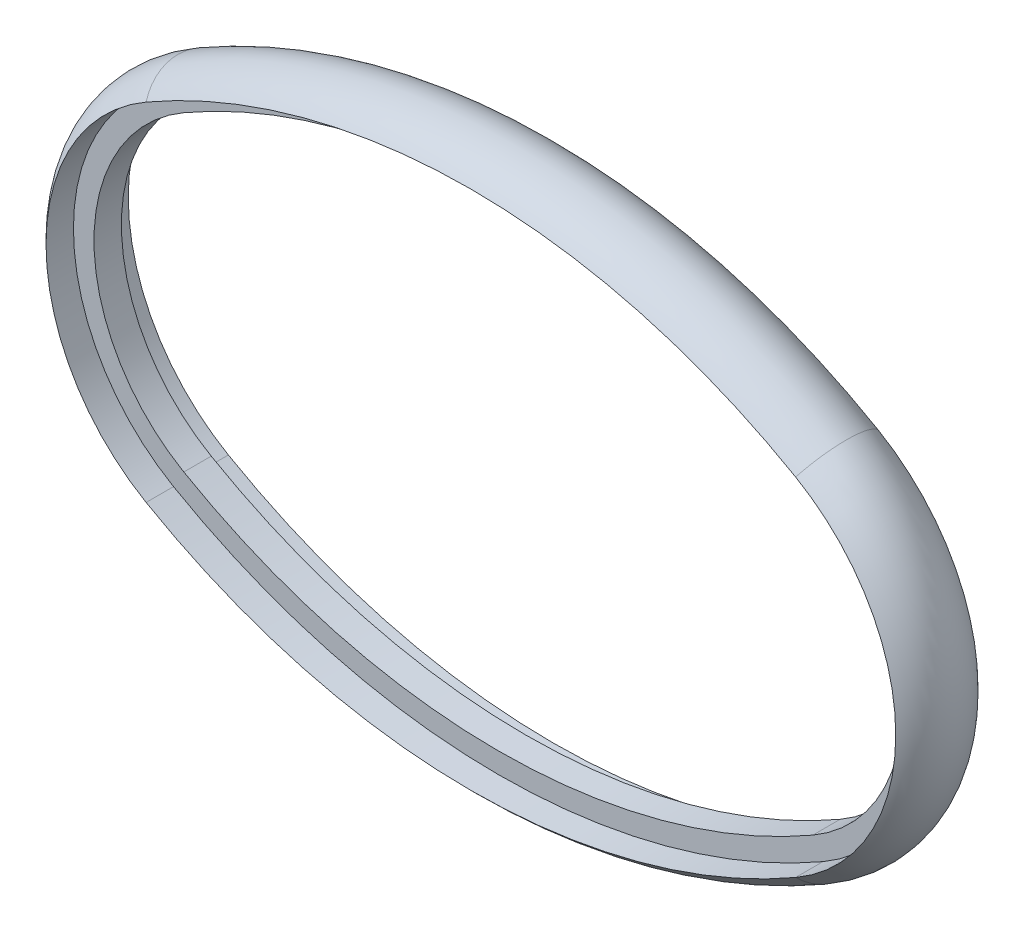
ISO-10303-21;
HEADER;
FILE_DESCRIPTION(('STEP AP214'),'2;1');
FILE_NAME('part.step','',(''),(''),'','','');
FILE_SCHEMA(('AUTOMOTIVE_DESIGN { 1 0 10303 214 1 1 1 1 }'));
ENDSEC;
DATA;
#1=APPLICATION_CONTEXT('core data for automotive mechanical design processes');
#2=APPLICATION_PROTOCOL_DEFINITION('international standard','automotive_design',2000,#1);
#3=PRODUCT_CONTEXT('',#1,'mechanical');
#4=PRODUCT('Part','Part','',(#3));
#5=PRODUCT_RELATED_PRODUCT_CATEGORY('part','',(#4));
#6=PRODUCT_DEFINITION_FORMATION('','',#4);
#7=PRODUCT_DEFINITION_CONTEXT('part definition',#1,'design');
#8=PRODUCT_DEFINITION('design','',#6,#7);
#9=PRODUCT_DEFINITION_SHAPE('','',#8);
#10=(LENGTH_UNIT() NAMED_UNIT(*) SI_UNIT(.MILLI.,.METRE.));
#11=(NAMED_UNIT(*) PLANE_ANGLE_UNIT() SI_UNIT($,.RADIAN.));
#12=(NAMED_UNIT(*) SI_UNIT($,.STERADIAN.) SOLID_ANGLE_UNIT());
#13=UNCERTAINTY_MEASURE_WITH_UNIT(LENGTH_MEASURE(1.E-05),#10,'distance_accuracy_value','');
#14=(GEOMETRIC_REPRESENTATION_CONTEXT(3) GLOBAL_UNCERTAINTY_ASSIGNED_CONTEXT((#13)) GLOBAL_UNIT_ASSIGNED_CONTEXT((#10,
#11,#12)) REPRESENTATION_CONTEXT('',''));
#15=CARTESIAN_POINT('',(0.,0.,0.));
#16=DIRECTION('',(0.,0.,1.));
#17=DIRECTION('',(1.,0.,0.));
#18=AXIS2_PLACEMENT_3D('',#15,#16,#17);
#19=CARTESIAN_POINT('',(16.3923048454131,-19.0000000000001,0.));
#20=DIRECTION('',(0.,0.,1.));
#21=DIRECTION('',(1.,0.,0.));
#22=AXIS2_PLACEMENT_3D('',#19,#20,#21);
#23=CYLINDRICAL_SURFACE('',#22,14.6076951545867);
#24=DIRECTION('',(0.,0.,-1.));
#25=VECTOR('',#24,1.);
#26=CARTESIAN_POINT('',(23.6961524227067,-31.6506350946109,-1.));
#27=LINE('',#26,#25);
#28=CARTESIAN_POINT('',(23.6961524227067,-31.6506350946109,-1.));
#29=VERTEX_POINT('',#28);
#30=CARTESIAN_POINT('',(23.6961524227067,-31.6506350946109,-3.));
#31=VERTEX_POINT('',#30);
#32=EDGE_CURVE('E223',#29,#31,#27,.T.);
#33=ORIENTED_EDGE('',*,*,#32,.F.);
#34=CARTESIAN_POINT('',(16.3923048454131,-19.0000000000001,-1.));
#35=DIRECTION('',(0.,0.,1.));
#36=DIRECTION('',(1.,0.,0.));
#37=AXIS2_PLACEMENT_3D('',#34,#35,#36);
#38=CIRCLE('',#37,14.6076951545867);
#39=CARTESIAN_POINT('',(23.6961524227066,-6.34936490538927,-1.));
#40=VERTEX_POINT('',#39);
#41=EDGE_CURVE('E53',#29,#40,#38,.T.);
#42=ORIENTED_EDGE('',*,*,#41,.T.);
#43=DIRECTION('',(0.,0.,-1.));
#44=VECTOR('',#43,1.);
#45=CARTESIAN_POINT('',(23.6961524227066,-6.34936490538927,-1.));
#46=LINE('',#45,#44);
#47=CARTESIAN_POINT('',(23.6961524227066,-6.34936490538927,-3.));
#48=VERTEX_POINT('',#47);
#49=EDGE_CURVE('E260',#40,#48,#46,.T.);
#50=ORIENTED_EDGE('',*,*,#49,.T.);
#51=CARTESIAN_POINT('',(16.3923048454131,-19.0000000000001,-3.));
#52=DIRECTION('',(0.,0.,1.));
#53=DIRECTION('',(1.,0.,0.));
#54=AXIS2_PLACEMENT_3D('',#51,#52,#53);
#55=CIRCLE('',#54,14.6076951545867);
#56=EDGE_CURVE('E11',#31,#48,#55,.T.);
#57=ORIENTED_EDGE('',*,*,#56,.F.);
#58=EDGE_LOOP('',(#33,#42,#50,#57));
#59=FACE_BOUND('',#58,.T.);
#60=ADVANCED_FACE('F44',(#59),#23,.F.);
#61=CARTESIAN_POINT('',(16.3923048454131,-19.0000000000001,0.));
#62=DIRECTION('',(0.,0.,1.));
#63=DIRECTION('',(1.,0.,0.));
#64=AXIS2_PLACEMENT_3D('',#61,#62,#63);
#65=CYLINDRICAL_SURFACE('',#64,13.1076951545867);
#66=DIRECTION('',(0.,0.,-1.));
#67=VECTOR('',#66,1.);
#68=CARTESIAN_POINT('',(22.9461524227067,-30.3515969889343,1.));
#69=LINE('',#68,#67);
#70=CARTESIAN_POINT('',(22.9461524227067,-30.3515969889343,1.));
#71=VERTEX_POINT('',#70);
#72=CARTESIAN_POINT('',(22.9461524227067,-30.3515969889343,-0.999999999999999));
#73=VERTEX_POINT('',#72);
#74=EDGE_CURVE('E219',#71,#73,#69,.T.);
#75=ORIENTED_EDGE('',*,*,#74,.F.);
#76=CARTESIAN_POINT('',(16.3923048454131,-19.0000000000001,1.));
#77=DIRECTION('',(0.,0.,1.));
#78=DIRECTION('',(1.,0.,0.));
#79=AXIS2_PLACEMENT_3D('',#76,#77,#78);
#80=CIRCLE('',#79,13.1076951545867);
#81=CARTESIAN_POINT('',(22.9461524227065,-7.64840301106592,1.));
#82=VERTEX_POINT('',#81);
#83=EDGE_CURVE('E272',#71,#82,#80,.T.);
#84=ORIENTED_EDGE('',*,*,#83,.T.);
#85=DIRECTION('',(0.,0.,-1.));
#86=VECTOR('',#85,1.);
#87=CARTESIAN_POINT('',(22.9461524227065,-7.64840301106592,1.));
#88=LINE('',#87,#86);
#89=CARTESIAN_POINT('',(22.9461524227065,-7.64840301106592,-0.999999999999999));
#90=VERTEX_POINT('',#89);
#91=EDGE_CURVE('E256',#82,#90,#88,.T.);
#92=ORIENTED_EDGE('',*,*,#91,.T.);
#93=CARTESIAN_POINT('',(16.3923048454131,-19.0000000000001,-0.999999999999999));
#94=DIRECTION('',(0.,0.,1.));
#95=DIRECTION('',(1.,0.,0.));
#96=AXIS2_PLACEMENT_3D('',#93,#94,#95);
#97=CIRCLE('',#96,13.1076951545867);
#98=EDGE_CURVE('E276',#73,#90,#97,.T.);
#99=ORIENTED_EDGE('',*,*,#98,.F.);
#100=EDGE_LOOP('',(#75,#84,#92,#99));
#101=FACE_BOUND('',#100,.T.);
#102=ADVANCED_FACE('F343',(#101),#65,.F.);
#103=CARTESIAN_POINT('',(16.3923048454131,-19.0000000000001,0.));
#104=DIRECTION('',(0.,0.,1.));
#105=DIRECTION('',(1.,0.,0.));
#106=AXIS2_PLACEMENT_3D('',#103,#104,#105);
#107=CYLINDRICAL_SURFACE('',#106,14.6076951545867);
#108=DIRECTION('',(0.,0.,-1.));
#109=VECTOR('',#108,1.);
#110=CARTESIAN_POINT('',(23.6961524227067,-31.6506350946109,3.));
#111=LINE('',#110,#109);
#112=CARTESIAN_POINT('',(23.6961524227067,-31.6506350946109,3.));
#113=VERTEX_POINT('',#112);
#114=CARTESIAN_POINT('',(23.6961524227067,-31.6506350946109,1.));
#115=VERTEX_POINT('',#114);
#116=EDGE_CURVE('E215',#113,#115,#111,.T.);
#117=ORIENTED_EDGE('',*,*,#116,.F.);
#118=CARTESIAN_POINT('',(16.3923048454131,-19.0000000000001,3.));
#119=DIRECTION('',(0.,0.,1.));
#120=DIRECTION('',(1.,0.,0.));
#121=AXIS2_PLACEMENT_3D('',#118,#119,#120);
#122=CIRCLE('',#121,14.6076951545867);
#123=CARTESIAN_POINT('',(23.6961524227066,-6.34936490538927,3.));
#124=VERTEX_POINT('',#123);
#125=EDGE_CURVE('E264',#113,#124,#122,.T.);
#126=ORIENTED_EDGE('',*,*,#125,.T.);
#127=DIRECTION('',(0.,0.,-1.));
#128=VECTOR('',#127,1.);
#129=CARTESIAN_POINT('',(23.6961524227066,-6.34936490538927,3.));
#130=LINE('',#129,#128);
#131=CARTESIAN_POINT('',(23.6961524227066,-6.34936490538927,1.));
#132=VERTEX_POINT('',#131);
#133=EDGE_CURVE('E165',#124,#132,#130,.T.);
#134=ORIENTED_EDGE('',*,*,#133,.T.);
#135=CARTESIAN_POINT('',(16.3923048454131,-19.0000000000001,1.));
#136=DIRECTION('',(0.,0.,1.));
#137=DIRECTION('',(1.,0.,0.));
#138=AXIS2_PLACEMENT_3D('',#135,#136,#137);
#139=CIRCLE('',#138,14.6076951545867);
#140=EDGE_CURVE('E268',#115,#132,#139,.T.);
#141=ORIENTED_EDGE('',*,*,#140,.F.);
#142=EDGE_LOOP('',(#117,#126,#134,#141));
#143=FACE_BOUND('',#142,.T.);
#144=ADVANCED_FACE('F307',(#143),#107,.F.);
#145=CARTESIAN_POINT('',(16.3923048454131,-19.0000000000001,0.));
#146=DIRECTION('',(0.,0.,1.));
#147=DIRECTION('',(1.,0.,0.));
#148=AXIS2_PLACEMENT_3D('',#145,#146,#147);
#149=TOROIDAL_SURFACE('',#148,11.9619438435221,4.);
#150=CARTESIAN_POINT('',(22.3732767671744,-29.359347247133,0.));
#151=DIRECTION('',(-0.866025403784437,-0.500000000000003,0.));
#152=DIRECTION('',(0.,0.,1.));
#153=AXIS2_PLACEMENT_3D('',#150,#151,#152);
#154=CIRCLE('',#153,4.);
#155=EDGE_CURVE('E211',#31,#113,#154,.T.);
#156=ORIENTED_EDGE('',*,*,#155,.F.);
#157=ORIENTED_EDGE('',*,*,#56,.T.);
#158=CARTESIAN_POINT('',(22.3732767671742,-8.64065275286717,0.));
#159=DIRECTION('',(0.866025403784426,-0.500000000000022,0.));
#160=DIRECTION('',(0.,0.,1.));
#161=AXIS2_PLACEMENT_3D('',#158,#159,#160);
#162=CIRCLE('',#161,4.);
#163=EDGE_CURVE('E251',#48,#124,#162,.T.);
#164=ORIENTED_EDGE('',*,*,#163,.T.);
#165=ORIENTED_EDGE('',*,*,#125,.F.);
#166=EDGE_LOOP('',(#156,#157,#164,#165));
#167=FACE_BOUND('',#166,.T.);
#168=ADVANCED_FACE('F316',(#167),#149,.T.);
#169=CARTESIAN_POINT('',(0.,9.39230484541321,0.));
#170=DIRECTION('',(0.,0.,1.));
#171=DIRECTION('',(1.,0.,0.));
#172=AXIS2_PLACEMENT_3D('',#169,#170,#171);
#173=CYLINDRICAL_SURFACE('',#172,47.3923048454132);
#174=DIRECTION('',(0.,0.,-1.));
#175=VECTOR('',#174,1.);
#176=CARTESIAN_POINT('',(-23.6961524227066,-31.650635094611,-1.));
#177=LINE('',#176,#175);
#178=CARTESIAN_POINT('',(-23.6961524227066,-31.650635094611,-1.));
#179=VERTEX_POINT('',#178);
#180=CARTESIAN_POINT('',(-23.6961524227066,-31.650635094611,-3.));
#181=VERTEX_POINT('',#180);
#182=EDGE_CURVE('E149',#179,#181,#177,.T.);
#183=ORIENTED_EDGE('',*,*,#182,.F.);
#184=CARTESIAN_POINT('',(0.,9.39230484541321,-1.));
#185=DIRECTION('',(0.,0.,1.));
#186=DIRECTION('',(1.,0.,0.));
#187=AXIS2_PLACEMENT_3D('',#184,#185,#186);
#188=CIRCLE('',#187,47.3923048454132);
#189=EDGE_CURVE('E243',#179,#29,#188,.T.);
#190=ORIENTED_EDGE('',*,*,#189,.T.);
#191=ORIENTED_EDGE('',*,*,#32,.T.);
#192=CARTESIAN_POINT('',(0.,9.39230484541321,-3.));
#193=DIRECTION('',(0.,0.,1.));
#194=DIRECTION('',(1.,0.,0.));
#195=AXIS2_PLACEMENT_3D('',#192,#193,#194);
#196=CIRCLE('',#195,47.3923048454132);
#197=EDGE_CURVE('E247',#181,#31,#196,.T.);
#198=ORIENTED_EDGE('',*,*,#197,.F.);
#199=EDGE_LOOP('',(#183,#190,#191,#198));
#200=FACE_BOUND('',#199,.T.);
#201=ADVANCED_FACE('F320',(#200),#173,.F.);
#202=CARTESIAN_POINT('',(0.,9.39230484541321,0.));
#203=DIRECTION('',(0.,0.,1.));
#204=DIRECTION('',(1.,0.,0.));
#205=AXIS2_PLACEMENT_3D('',#202,#203,#204);
#206=CYLINDRICAL_SURFACE('',#205,45.8923048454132);
#207=DIRECTION('',(0.,0.,-1.));
#208=VECTOR('',#207,1.);
#209=CARTESIAN_POINT('',(-22.9461524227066,-30.3515969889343,1.));
#210=LINE('',#209,#208);
#211=CARTESIAN_POINT('',(-22.9461524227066,-30.3515969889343,1.));
#212=VERTEX_POINT('',#211);
#213=CARTESIAN_POINT('',(-22.9461524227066,-30.3515969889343,-0.999999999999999));
#214=VERTEX_POINT('',#213);
#215=EDGE_CURVE('E187',#212,#214,#210,.T.);
#216=ORIENTED_EDGE('',*,*,#215,.F.);
#217=CARTESIAN_POINT('',(0.,9.39230484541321,1.));
#218=DIRECTION('',(0.,0.,1.));
#219=DIRECTION('',(1.,0.,0.));
#220=AXIS2_PLACEMENT_3D('',#217,#218,#219);
#221=CIRCLE('',#220,45.8923048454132);
#222=EDGE_CURVE('E235',#212,#71,#221,.T.);
#223=ORIENTED_EDGE('',*,*,#222,.T.);
#224=ORIENTED_EDGE('',*,*,#74,.T.);
#225=CARTESIAN_POINT('',(0.,9.39230484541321,-0.999999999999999));
#226=DIRECTION('',(0.,0.,1.));
#227=DIRECTION('',(1.,0.,0.));
#228=AXIS2_PLACEMENT_3D('',#225,#226,#227);
#229=CIRCLE('',#228,45.8923048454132);
#230=EDGE_CURVE('E239',#214,#73,#229,.T.);
#231=ORIENTED_EDGE('',*,*,#230,.F.);
#232=EDGE_LOOP('',(#216,#223,#224,#231));
#233=FACE_BOUND('',#232,.T.);
#234=ADVANCED_FACE('F340',(#233),#206,.F.);
#235=CARTESIAN_POINT('',(0.,9.39230484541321,0.));
#236=DIRECTION('',(0.,0.,1.));
#237=DIRECTION('',(1.,0.,0.));
#238=AXIS2_PLACEMENT_3D('',#235,#236,#237);
#239=CYLINDRICAL_SURFACE('',#238,47.3923048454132);
#240=DIRECTION('',(0.,0.,-1.));
#241=VECTOR('',#240,1.);
#242=CARTESIAN_POINT('',(-23.6961524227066,-31.650635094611,3.));
#243=LINE('',#242,#241);
#244=CARTESIAN_POINT('',(-23.6961524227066,-31.650635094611,3.));
#245=VERTEX_POINT('',#244);
#246=CARTESIAN_POINT('',(-23.6961524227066,-31.650635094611,1.));
#247=VERTEX_POINT('',#246);
#248=EDGE_CURVE('E184',#245,#247,#243,.T.);
#249=ORIENTED_EDGE('',*,*,#248,.F.);
#250=CARTESIAN_POINT('',(0.,9.39230484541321,3.));
#251=DIRECTION('',(0.,0.,1.));
#252=DIRECTION('',(1.,0.,0.));
#253=AXIS2_PLACEMENT_3D('',#250,#251,#252);
#254=CIRCLE('',#253,47.3923048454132);
#255=EDGE_CURVE('E227',#245,#113,#254,.T.);
#256=ORIENTED_EDGE('',*,*,#255,.T.);
#257=ORIENTED_EDGE('',*,*,#116,.T.);
#258=CARTESIAN_POINT('',(0.,9.39230484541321,1.));
#259=DIRECTION('',(0.,0.,1.));
#260=DIRECTION('',(1.,0.,0.));
#261=AXIS2_PLACEMENT_3D('',#258,#259,#260);
#262=CIRCLE('',#261,47.3923048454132);
#263=EDGE_CURVE('E231',#247,#115,#262,.T.);
#264=ORIENTED_EDGE('',*,*,#263,.F.);
#265=EDGE_LOOP('',(#249,#256,#257,#264));
#266=FACE_BOUND('',#265,.T.);
#267=ADVANCED_FACE('F311',(#266),#239,.F.);
#268=CARTESIAN_POINT('',(0.,9.39230484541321,0.));
#269=DIRECTION('',(0.,0.,1.));
#270=DIRECTION('',(1.,0.,0.));
#271=AXIS2_PLACEMENT_3D('',#268,#269,#270);
#272=TOROIDAL_SURFACE('',#271,44.7465535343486,4.);
#273=CARTESIAN_POINT('',(-22.3732767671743,-29.359347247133,0.));
#274=DIRECTION('',(-0.866025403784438,0.5,0.));
#275=DIRECTION('',(0.,0.,1.));
#276=AXIS2_PLACEMENT_3D('',#273,#274,#275);
#277=CIRCLE('',#276,4.);
#278=EDGE_CURVE('E144',#181,#245,#277,.T.);
#279=ORIENTED_EDGE('',*,*,#278,.F.);
#280=ORIENTED_EDGE('',*,*,#197,.T.);
#281=ORIENTED_EDGE('',*,*,#155,.T.);
#282=ORIENTED_EDGE('',*,*,#255,.F.);
#283=EDGE_LOOP('',(#279,#280,#281,#282));
#284=FACE_BOUND('',#283,.T.);
#285=ADVANCED_FACE('F314',(#284),#272,.T.);
#286=CARTESIAN_POINT('',(-16.3923048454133,-19.,0.));
#287=DIRECTION('',(0.,0.,1.));
#288=DIRECTION('',(1.,0.,0.));
#289=AXIS2_PLACEMENT_3D('',#286,#287,#288);
#290=CYLINDRICAL_SURFACE('',#289,14.6076951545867);
#291=DIRECTION('',(0.,0.,-1.));
#292=VECTOR('',#291,1.);
#293=CARTESIAN_POINT('',(-23.6961524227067,-6.34936490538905,-1.));
#294=LINE('',#293,#292);
#295=CARTESIAN_POINT('',(-23.6961524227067,-6.34936490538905,-1.));
#296=VERTEX_POINT('',#295);
#297=CARTESIAN_POINT('',(-23.6961524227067,-6.34936490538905,-3.));
#298=VERTEX_POINT('',#297);
#299=EDGE_CURVE('E170',#296,#298,#294,.T.);
#300=ORIENTED_EDGE('',*,*,#299,.F.);
#301=CARTESIAN_POINT('',(-16.3923048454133,-19.,-1.));
#302=DIRECTION('',(0.,0.,1.));
#303=DIRECTION('',(1.,0.,0.));
#304=AXIS2_PLACEMENT_3D('',#301,#302,#303);
#305=CIRCLE('',#304,14.6076951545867);
#306=EDGE_CURVE('E204',#296,#179,#305,.T.);
#307=ORIENTED_EDGE('',*,*,#306,.T.);
#308=ORIENTED_EDGE('',*,*,#182,.T.);
#309=CARTESIAN_POINT('',(-16.3923048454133,-19.,-3.));
#310=DIRECTION('',(0.,0.,1.));
#311=DIRECTION('',(1.,0.,0.));
#312=AXIS2_PLACEMENT_3D('',#309,#310,#311);
#313=CIRCLE('',#312,14.6076951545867);
#314=EDGE_CURVE('E208',#298,#181,#313,.T.);
#315=ORIENTED_EDGE('',*,*,#314,.F.);
#316=EDGE_LOOP('',(#300,#307,#308,#315));
#317=FACE_BOUND('',#316,.T.);
#318=ADVANCED_FACE('F325',(#317),#290,.F.);
#319=CARTESIAN_POINT('',(-16.3923048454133,-19.,0.));
#320=DIRECTION('',(0.,0.,1.));
#321=DIRECTION('',(1.,0.,0.));
#322=AXIS2_PLACEMENT_3D('',#319,#320,#321);
#323=CYLINDRICAL_SURFACE('',#322,13.1076951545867);
#324=DIRECTION('',(0.,0.,-1.));
#325=VECTOR('',#324,1.);
#326=CARTESIAN_POINT('',(-22.9461524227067,-7.64840301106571,1.));
#327=LINE('',#326,#325);
#328=CARTESIAN_POINT('',(-22.9461524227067,-7.64840301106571,1.));
#329=VERTEX_POINT('',#328);
#330=CARTESIAN_POINT('',(-22.9461524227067,-7.64840301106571,-0.999999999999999));
#331=VERTEX_POINT('',#330);
#332=EDGE_CURVE('E159',#329,#331,#327,.T.);
#333=ORIENTED_EDGE('',*,*,#332,.F.);
#334=CARTESIAN_POINT('',(-16.3923048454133,-19.,1.));
#335=DIRECTION('',(0.,0.,1.));
#336=DIRECTION('',(1.,0.,0.));
#337=AXIS2_PLACEMENT_3D('',#334,#335,#336);
#338=CIRCLE('',#337,13.1076951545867);
#339=EDGE_CURVE('E196',#329,#212,#338,.T.);
#340=ORIENTED_EDGE('',*,*,#339,.T.);
#341=ORIENTED_EDGE('',*,*,#215,.T.);
#342=CARTESIAN_POINT('',(-16.3923048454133,-19.,-0.999999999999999));
#343=DIRECTION('',(0.,0.,1.));
#344=DIRECTION('',(1.,0.,0.));
#345=AXIS2_PLACEMENT_3D('',#342,#343,#344);
#346=CIRCLE('',#345,13.1076951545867);
#347=EDGE_CURVE('E200',#331,#214,#346,.T.);
#348=ORIENTED_EDGE('',*,*,#347,.F.);
#349=EDGE_LOOP('',(#333,#340,#341,#348));
#350=FACE_BOUND('',#349,.T.);
#351=ADVANCED_FACE('F337',(#350),#323,.F.);
#352=CARTESIAN_POINT('',(-16.3923048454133,-19.,0.));
#353=DIRECTION('',(0.,0.,1.));
#354=DIRECTION('',(1.,0.,0.));
#355=AXIS2_PLACEMENT_3D('',#352,#353,#354);
#356=CYLINDRICAL_SURFACE('',#355,14.6076951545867);
#357=DIRECTION('',(0.,0.,-1.));
#358=VECTOR('',#357,1.);
#359=CARTESIAN_POINT('',(-23.6961524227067,-6.34936490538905,3.));
#360=LINE('',#359,#358);
#361=CARTESIAN_POINT('',(-23.6961524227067,-6.34936490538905,3.));
#362=VERTEX_POINT('',#361);
#363=CARTESIAN_POINT('',(-23.6961524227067,-6.34936490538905,1.));
#364=VERTEX_POINT('',#363);
#365=EDGE_CURVE('E152',#362,#364,#360,.T.);
#366=ORIENTED_EDGE('',*,*,#365,.F.);
#367=CARTESIAN_POINT('',(-16.3923048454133,-19.,3.));
#368=DIRECTION('',(0.,0.,1.));
#369=DIRECTION('',(1.,0.,0.));
#370=AXIS2_PLACEMENT_3D('',#367,#368,#369);
#371=CIRCLE('',#370,14.6076951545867);
#372=EDGE_CURVE('E137',#362,#245,#371,.T.);
#373=ORIENTED_EDGE('',*,*,#372,.T.);
#374=ORIENTED_EDGE('',*,*,#248,.T.);
#375=CARTESIAN_POINT('',(-16.3923048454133,-19.,1.));
#376=DIRECTION('',(0.,0.,1.));
#377=DIRECTION('',(1.,0.,0.));
#378=AXIS2_PLACEMENT_3D('',#375,#376,#377);
#379=CIRCLE('',#378,14.6076951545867);
#380=EDGE_CURVE('E148',#364,#247,#379,.T.);
#381=ORIENTED_EDGE('',*,*,#380,.F.);
#382=EDGE_LOOP('',(#366,#373,#374,#381));
#383=FACE_BOUND('',#382,.T.);
#384=ADVANCED_FACE('F154',(#383),#356,.F.);
#385=CARTESIAN_POINT('',(-16.3923048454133,-19.,0.));
#386=DIRECTION('',(0.,0.,1.));
#387=DIRECTION('',(1.,0.,0.));
#388=AXIS2_PLACEMENT_3D('',#385,#386,#387);
#389=TOROIDAL_SURFACE('',#388,11.9619438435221,4.);
#390=CARTESIAN_POINT('',(-22.3732767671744,-8.64065275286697,0.));
#391=DIRECTION('',(0.866025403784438,0.500000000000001,0.));
#392=DIRECTION('',(0.,0.,1.));
#393=AXIS2_PLACEMENT_3D('',#390,#391,#392);
#394=CIRCLE('',#393,4.);
#395=EDGE_CURVE('E142',#298,#362,#394,.T.);
#396=ORIENTED_EDGE('',*,*,#395,.F.);
#397=ORIENTED_EDGE('',*,*,#314,.T.);
#398=ORIENTED_EDGE('',*,*,#278,.T.);
#399=ORIENTED_EDGE('',*,*,#372,.F.);
#400=EDGE_LOOP('',(#396,#397,#398,#399));
#401=FACE_BOUND('',#400,.T.);
#402=ADVANCED_FACE('F139',(#401),#389,.T.);
#403=CARTESIAN_POINT('',(0.,-47.3923048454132,0.));
#404=DIRECTION('',(0.,0.,-1.));
#405=DIRECTION('',(-1.,0.,0.));
#406=AXIS2_PLACEMENT_3D('',#403,#404,#405);
#407=TOROIDAL_SURFACE('',#406,44.7465535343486,4.);
#408=CARTESIAN_POINT('',(0.,-47.3923048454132,-3.));
#409=DIRECTION('',(0.,0.,-1.));
#410=DIRECTION('',(-1.,0.,0.));
#411=AXIS2_PLACEMENT_3D('',#408,#409,#410);
#412=CIRCLE('',#411,47.3923048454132);
#413=EDGE_CURVE('E61',#298,#48,#412,.T.);
#414=ORIENTED_EDGE('',*,*,#413,.F.);
#415=ORIENTED_EDGE('',*,*,#395,.T.);
#416=CARTESIAN_POINT('',(0.,-47.3923048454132,3.));
#417=DIRECTION('',(0.,0.,-1.));
#418=DIRECTION('',(-1.,0.,0.));
#419=AXIS2_PLACEMENT_3D('',#416,#417,#418);
#420=CIRCLE('',#419,47.3923048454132);
#421=EDGE_CURVE('E162',#362,#124,#420,.T.);
#422=ORIENTED_EDGE('',*,*,#421,.T.);
#423=ORIENTED_EDGE('',*,*,#163,.F.);
#424=EDGE_LOOP('',(#414,#415,#422,#423));
#425=FACE_BOUND('',#424,.T.);
#426=ADVANCED_FACE('F172',(#425),#407,.T.);
#427=CARTESIAN_POINT('',(0.,-47.3923048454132,0.));
#428=DIRECTION('',(0.,0.,-1.));
#429=DIRECTION('',(-1.,0.,0.));
#430=AXIS2_PLACEMENT_3D('',#427,#428,#429);
#431=CYLINDRICAL_SURFACE('',#430,47.3923048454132);
#432=CARTESIAN_POINT('',(0.,-47.3923048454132,-1.));
#433=DIRECTION('',(0.,0.,-1.));
#434=DIRECTION('',(-1.,0.,0.));
#435=AXIS2_PLACEMENT_3D('',#432,#433,#434);
#436=CIRCLE('',#435,47.3923048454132);
#437=EDGE_CURVE('E69',#296,#40,#436,.T.);
#438=ORIENTED_EDGE('',*,*,#437,.F.);
#439=ORIENTED_EDGE('',*,*,#299,.T.);
#440=ORIENTED_EDGE('',*,*,#413,.T.);
#441=ORIENTED_EDGE('',*,*,#49,.F.);
#442=EDGE_LOOP('',(#438,#439,#440,#441));
#443=FACE_BOUND('',#442,.T.);
#444=ADVANCED_FACE('F322',(#443),#431,.F.);
#445=CARTESIAN_POINT('',(-22.9461524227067,-7.64840301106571,-1.));
#446=DIRECTION('',(0.,0.,-1.));
#447=DIRECTION('',(-1.,0.,0.));
#448=AXIS2_PLACEMENT_3D('',#445,#446,#447);
#449=PLANE('',#448);
#450=ORIENTED_EDGE('',*,*,#306,.F.);
#451=ORIENTED_EDGE('',*,*,#437,.T.);
#452=ORIENTED_EDGE('',*,*,#41,.F.);
#453=ORIENTED_EDGE('',*,*,#189,.F.);
#454=EDGE_LOOP('',(#450,#451,#452,#453));
#455=FACE_BOUND('',#454,.T.);
#456=CARTESIAN_POINT('',(0.,-47.3923048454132,-0.999999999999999));
#457=DIRECTION('',(0.,0.,-1.));
#458=DIRECTION('',(-1.,0.,0.));
#459=AXIS2_PLACEMENT_3D('',#456,#457,#458);
#460=CIRCLE('',#459,45.8923048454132);
#461=EDGE_CURVE('E291',#331,#90,#460,.T.);
#462=ORIENTED_EDGE('',*,*,#461,.F.);
#463=ORIENTED_EDGE('',*,*,#347,.T.);
#464=ORIENTED_EDGE('',*,*,#230,.T.);
#465=ORIENTED_EDGE('',*,*,#98,.T.);
#466=EDGE_LOOP('',(#462,#463,#464,#465));
#467=FACE_BOUND('',#466,.T.);
#468=ADVANCED_FACE('F326',(#455,#467),#449,.T.);
#469=CARTESIAN_POINT('',(0.,-47.3923048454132,0.));
#470=DIRECTION('',(0.,0.,-1.));
#471=DIRECTION('',(-1.,0.,0.));
#472=AXIS2_PLACEMENT_3D('',#469,#470,#471);
#473=CYLINDRICAL_SURFACE('',#472,45.8923048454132);
#474=CARTESIAN_POINT('',(0.,-47.3923048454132,1.));
#475=DIRECTION('',(0.,0.,-1.));
#476=DIRECTION('',(-1.,0.,0.));
#477=AXIS2_PLACEMENT_3D('',#474,#475,#476);
#478=CIRCLE('',#477,45.8923048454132);
#479=EDGE_CURVE('E296',#329,#82,#478,.T.);
#480=ORIENTED_EDGE('',*,*,#479,.F.);
#481=ORIENTED_EDGE('',*,*,#332,.T.);
#482=ORIENTED_EDGE('',*,*,#461,.T.);
#483=ORIENTED_EDGE('',*,*,#91,.F.);
#484=EDGE_LOOP('',(#480,#481,#482,#483));
#485=FACE_BOUND('',#484,.T.);
#486=ADVANCED_FACE('F329',(#485),#473,.F.);
#487=CARTESIAN_POINT('',(-23.6961524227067,-6.34936490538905,1.));
#488=DIRECTION('',(0.,0.,1.));
#489=DIRECTION('',(1.,0.,0.));
#490=AXIS2_PLACEMENT_3D('',#487,#488,#489);
#491=PLANE('',#490);
#492=ORIENTED_EDGE('',*,*,#339,.F.);
#493=ORIENTED_EDGE('',*,*,#479,.T.);
#494=ORIENTED_EDGE('',*,*,#83,.F.);
#495=ORIENTED_EDGE('',*,*,#222,.F.);
#496=EDGE_LOOP('',(#492,#493,#494,#495));
#497=FACE_BOUND('',#496,.T.);
#498=CARTESIAN_POINT('',(0.,-47.3923048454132,1.));
#499=DIRECTION('',(0.,0.,-1.));
#500=DIRECTION('',(-1.,0.,0.));
#501=AXIS2_PLACEMENT_3D('',#498,#499,#500);
#502=CIRCLE('',#501,47.3923048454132);
#503=EDGE_CURVE('E169',#364,#132,#502,.T.);
#504=ORIENTED_EDGE('',*,*,#503,.F.);
#505=ORIENTED_EDGE('',*,*,#380,.T.);
#506=ORIENTED_EDGE('',*,*,#263,.T.);
#507=ORIENTED_EDGE('',*,*,#140,.T.);
#508=EDGE_LOOP('',(#504,#505,#506,#507));
#509=FACE_BOUND('',#508,.T.);
#510=ADVANCED_FACE('F308',(#497,#509),#491,.T.);
#511=CARTESIAN_POINT('',(0.,-47.3923048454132,0.));
#512=DIRECTION('',(0.,0.,-1.));
#513=DIRECTION('',(-1.,0.,0.));
#514=AXIS2_PLACEMENT_3D('',#511,#512,#513);
#515=CYLINDRICAL_SURFACE('',#514,47.3923048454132);
#516=ORIENTED_EDGE('',*,*,#365,.T.);
#517=ORIENTED_EDGE('',*,*,#503,.T.);
#518=ORIENTED_EDGE('',*,*,#133,.F.);
#519=ORIENTED_EDGE('',*,*,#421,.F.);
#520=EDGE_LOOP('',(#516,#517,#518,#519));
#521=FACE_BOUND('',#520,.T.);
#522=ADVANCED_FACE('F163',(#521),#515,.F.);
#523=CLOSED_SHELL('',(#60,#102,#144,#168,#201,#234,#267,#285,#318,#351,#384,#402,#426,#444,#468,
#486,#510,#522));
#524=MANIFOLD_SOLID_BREP('B2',#523);
#525=ADVANCED_BREP_SHAPE_REPRESENTATION('',(#18,#524),#14);
#526=SHAPE_DEFINITION_REPRESENTATION(#9,#525);
ENDSEC;
END-ISO-10303-21;
